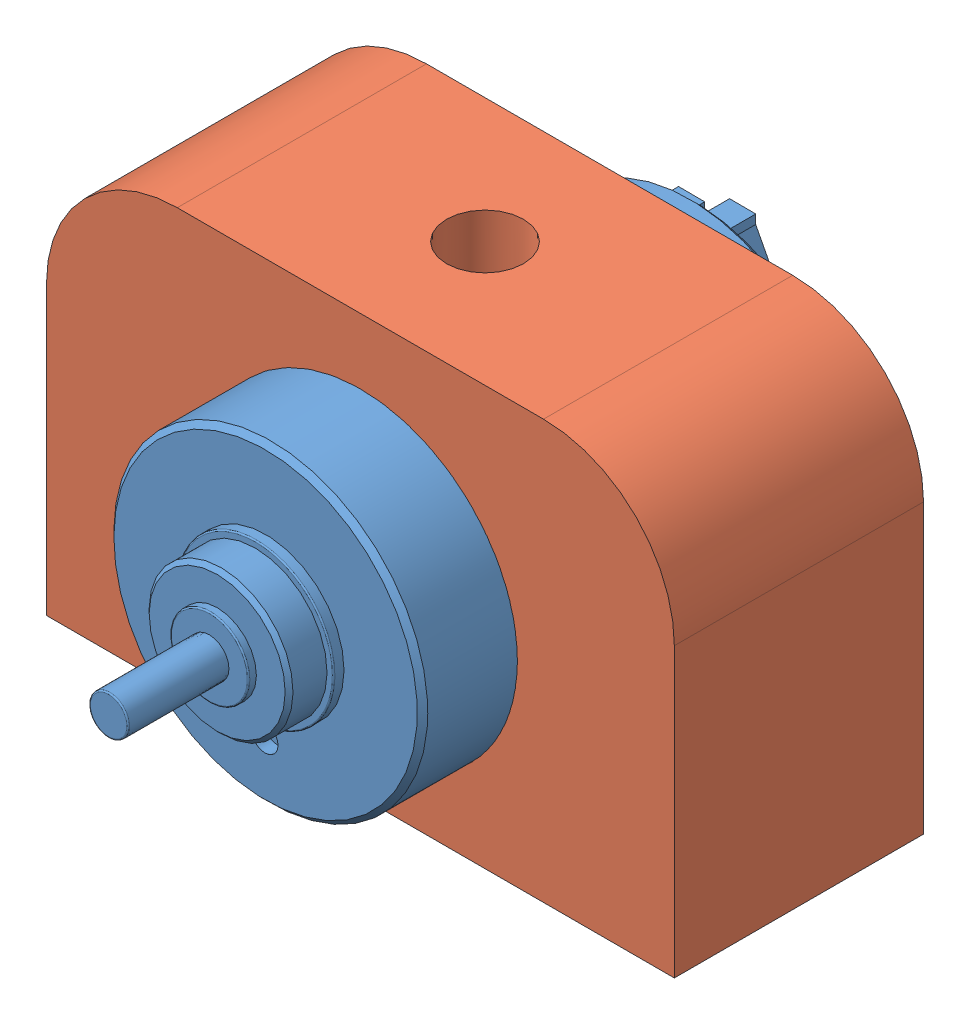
SolidWorks assembly MOTOR_ASSEM.SLDASM, configuration Default (file format 7000). Lengths in mm.
Overall size (24 16 24.1).
2 component instances, 2 part files, 2 mates.
Components (placement in the parent):
- ADM_1220-1: ADM_1220.SLDPRT [Default] at (-12.6547 13.2435 11.3267) x (0 0 1) z (-0.999978 0.006599 0) size (24.1 12 12)
- Motor Mount (v2)-1: Motor Mount (v2).SLDPRT [Default] at (-24.6547 5.7435 4.2267) size (24 16 9.53)
Mates (geometry in assembly coordinates):
- Concentric1: concentric anti-aligned: circle of ADM_1220-1; circle of Motor Mount (v2)-1
- Distance1: distance = 3.25 mm aligned: plane of ADM_1220-1 through (-12.6547 13.2435 0.9767) normal (0 0 -1); plane of Motor Mount (v2)-1 through (-24.6547 5.7435 4.2267) normal (0 0 -1)
